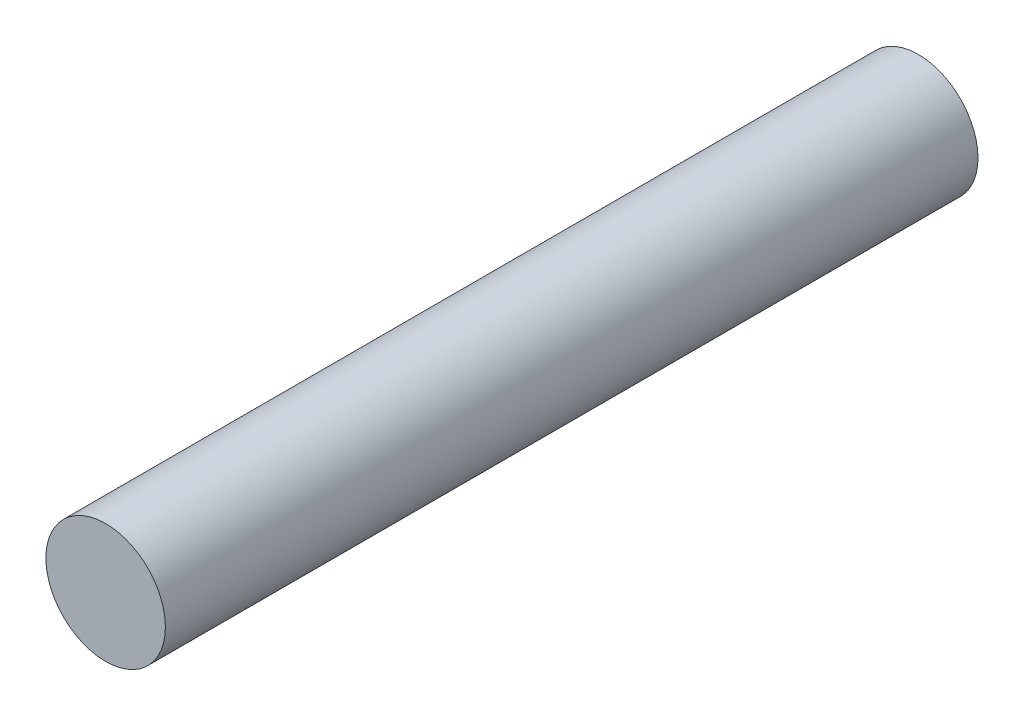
from build123d import *

# Parameters (mm, degrees)
BASE_EXTRUSION_DEPTH      = 8.5
BASE_EXTRUSION_DEPTH_BACK = 8.5
ESQUISSE1_R               = 1.25


with BuildPart() as part:
    # Esquisse1 → Base-Extrusion (new, two sides: drawn at the far end of the back side and taken through both)
    with BuildSketch(Plane.XY.offset(-BASE_EXTRUSION_DEPTH_BACK)):
        Circle(ESQUISSE1_R)
    extrude(amount=BASE_EXTRUSION_DEPTH + BASE_EXTRUSION_DEPTH_BACK)


solid = part.part
